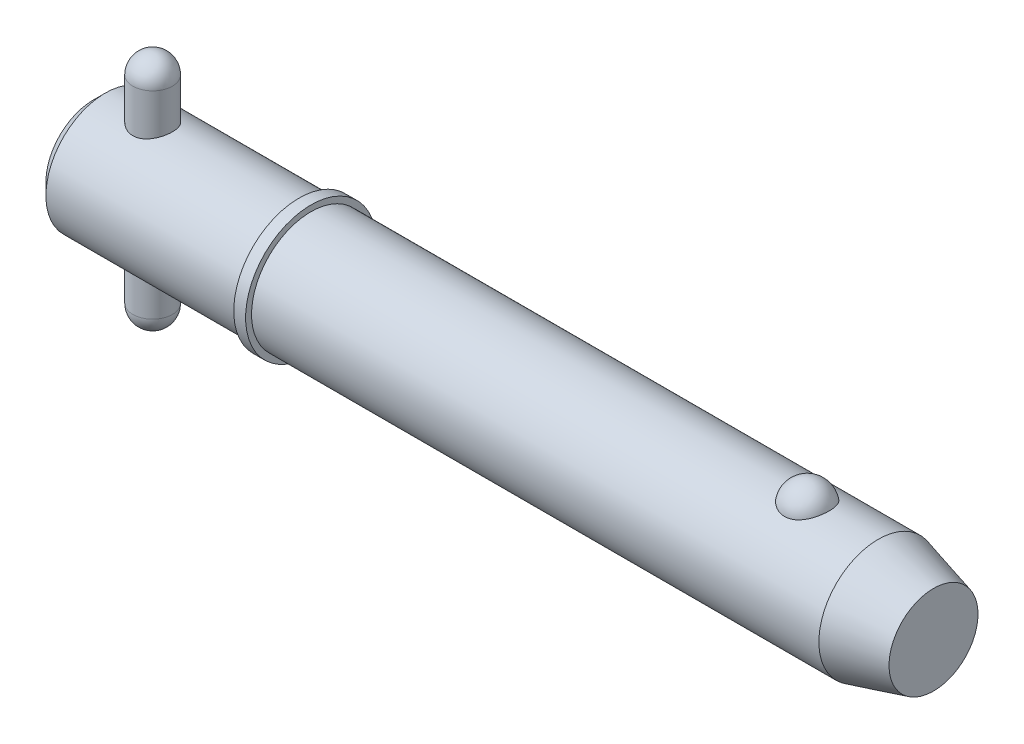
ISO-10303-21;
HEADER;
FILE_DESCRIPTION(('STEP AP214'),'2;1');
FILE_NAME('part.step','',(''),(''),'','','');
FILE_SCHEMA(('AUTOMOTIVE_DESIGN { 1 0 10303 214 1 1 1 1 }'));
ENDSEC;
DATA;
#1=APPLICATION_CONTEXT('core data for automotive mechanical design processes');
#2=APPLICATION_PROTOCOL_DEFINITION('international standard','automotive_design',2000,#1);
#3=PRODUCT_CONTEXT('',#1,'mechanical');
#4=PRODUCT('Part','Part','',(#3));
#5=PRODUCT_RELATED_PRODUCT_CATEGORY('part','',(#4));
#6=PRODUCT_DEFINITION_FORMATION('','',#4);
#7=PRODUCT_DEFINITION_CONTEXT('part definition',#1,'design');
#8=PRODUCT_DEFINITION('design','',#6,#7);
#9=PRODUCT_DEFINITION_SHAPE('','',#8);
#10=(LENGTH_UNIT() NAMED_UNIT(*) SI_UNIT(.MILLI.,.METRE.));
#11=(NAMED_UNIT(*) PLANE_ANGLE_UNIT() SI_UNIT($,.RADIAN.));
#12=(NAMED_UNIT(*) SI_UNIT($,.STERADIAN.) SOLID_ANGLE_UNIT());
#13=UNCERTAINTY_MEASURE_WITH_UNIT(LENGTH_MEASURE(1.E-05),#10,'distance_accuracy_value','');
#14=(GEOMETRIC_REPRESENTATION_CONTEXT(3) GLOBAL_UNCERTAINTY_ASSIGNED_CONTEXT((#13)) GLOBAL_UNIT_ASSIGNED_CONTEXT((#10,
#11,#12)) REPRESENTATION_CONTEXT('',''));
#15=CARTESIAN_POINT('',(0.,0.,0.));
#16=DIRECTION('',(0.,0.,1.));
#17=DIRECTION('',(1.,0.,0.));
#18=AXIS2_PLACEMENT_3D('',#15,#16,#17);
#19=CARTESIAN_POINT('',(9.525,19.05,0.));
#20=DIRECTION('',(0.,-1.,0.));
#21=DIRECTION('',(0.,0.,-1.));
#22=AXIS2_PLACEMENT_3D('',#19,#20,#21);
#23=CYLINDRICAL_SURFACE('',#22,3.175);
#24=CARTESIAN_POINT('',(9.525,-15.875,0.));
#25=DIRECTION('',(0.,-1.,0.));
#26=DIRECTION('',(0.,0.,-1.));
#27=AXIS2_PLACEMENT_3D('',#24,#25,#26);
#28=CIRCLE('',#27,3.175);
#29=CARTESIAN_POINT('',(9.525,-15.875,-3.175));
#30=VERTEX_POINT('',#29);
#31=EDGE_CURVE('P0_E10',#30,#30,#28,.F.);
#32=CARTESIAN_POINT('',(9.525,15.875,0.));
#33=DIRECTION('',(0.,-1.,0.));
#34=DIRECTION('',(0.,0.,-1.));
#35=AXIS2_PLACEMENT_3D('',#32,#33,#34);
#36=CIRCLE('',#35,3.175);
#37=CARTESIAN_POINT('',(9.525,15.875,-3.175));
#38=VERTEX_POINT('',#37);
#39=EDGE_CURVE('P0_E21',#38,#38,#36,.T.);
#40=CARTESIAN_POINT('',(9.525,-15.875,-3.175));
#41=CARTESIAN_POINT('',(9.525,-15.5442708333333,-3.175));
#42=CARTESIAN_POINT('',(9.525,-15.2135416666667,-3.175));
#43=CARTESIAN_POINT('',(9.525,-14.5520833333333,-3.175));
#44=CARTESIAN_POINT('',(9.525,-14.2213541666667,-3.175));
#45=CARTESIAN_POINT('',(9.525,-13.5598958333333,-3.175));
#46=CARTESIAN_POINT('',(9.525,-13.2291666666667,-3.175));
#47=CARTESIAN_POINT('',(9.525,-12.5677083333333,-3.175));
#48=CARTESIAN_POINT('',(9.525,-12.2369791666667,-3.175));
#49=CARTESIAN_POINT('',(9.525,-11.5755208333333,-3.175));
#50=CARTESIAN_POINT('',(9.525,-11.2447916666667,-3.175));
#51=CARTESIAN_POINT('',(9.525,-10.5833333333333,-3.175));
#52=CARTESIAN_POINT('',(9.525,-10.2526041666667,-3.175));
#53=CARTESIAN_POINT('',(9.525,-9.59114583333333,-3.175));
#54=CARTESIAN_POINT('',(9.525,-9.26041666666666,-3.175));
#55=CARTESIAN_POINT('',(9.525,-8.59895833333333,-3.175));
#56=CARTESIAN_POINT('',(9.525,-8.26822916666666,-3.175));
#57=CARTESIAN_POINT('',(9.525,-7.60677083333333,-3.175));
#58=CARTESIAN_POINT('',(9.525,-7.27604166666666,-3.175));
#59=CARTESIAN_POINT('',(9.525,-6.61458333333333,-3.175));
#60=CARTESIAN_POINT('',(9.525,-6.28385416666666,-3.175));
#61=CARTESIAN_POINT('',(9.525,-5.62239583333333,-3.175));
#62=CARTESIAN_POINT('',(9.525,-5.29166666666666,-3.175));
#63=CARTESIAN_POINT('',(9.525,-4.63020833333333,-3.175));
#64=CARTESIAN_POINT('',(9.525,-4.29947916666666,-3.175));
#65=CARTESIAN_POINT('',(9.525,-3.63802083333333,-3.175));
#66=CARTESIAN_POINT('',(9.525,-3.30729166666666,-3.175));
#67=CARTESIAN_POINT('',(9.525,-2.64583333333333,-3.175));
#68=CARTESIAN_POINT('',(9.525,-2.31510416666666,-3.175));
#69=CARTESIAN_POINT('',(9.525,-1.65364583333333,-3.175));
#70=CARTESIAN_POINT('',(9.525,-1.32291666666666,-3.175));
#71=CARTESIAN_POINT('',(9.525,-0.661458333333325,-3.175));
#72=CARTESIAN_POINT('',(9.525,-0.330729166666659,-3.175));
#73=CARTESIAN_POINT('',(9.525,0.330729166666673,-3.175));
#74=CARTESIAN_POINT('',(9.525,0.661458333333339,-3.175));
#75=CARTESIAN_POINT('',(9.525,1.32291666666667,-3.175));
#76=CARTESIAN_POINT('',(9.525,1.65364583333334,-3.175));
#77=CARTESIAN_POINT('',(9.525,2.31510416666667,-3.175));
#78=CARTESIAN_POINT('',(9.525,2.64583333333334,-3.175));
#79=CARTESIAN_POINT('',(9.525,3.30729166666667,-3.175));
#80=CARTESIAN_POINT('',(9.525,3.63802083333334,-3.175));
#81=CARTESIAN_POINT('',(9.525,4.29947916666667,-3.175));
#82=CARTESIAN_POINT('',(9.525,4.63020833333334,-3.175));
#83=CARTESIAN_POINT('',(9.525,5.29166666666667,-3.175));
#84=CARTESIAN_POINT('',(9.525,5.62239583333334,-3.175));
#85=CARTESIAN_POINT('',(9.525,6.28385416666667,-3.175));
#86=CARTESIAN_POINT('',(9.525,6.61458333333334,-3.175));
#87=CARTESIAN_POINT('',(9.525,7.27604166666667,-3.175));
#88=CARTESIAN_POINT('',(9.525,7.60677083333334,-3.175));
#89=CARTESIAN_POINT('',(9.525,8.26822916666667,-3.175));
#90=CARTESIAN_POINT('',(9.525,8.59895833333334,-3.175));
#91=CARTESIAN_POINT('',(9.525,9.26041666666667,-3.175));
#92=CARTESIAN_POINT('',(9.525,9.59114583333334,-3.175));
#93=CARTESIAN_POINT('',(9.525,10.2526041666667,-3.175));
#94=CARTESIAN_POINT('',(9.525,10.5833333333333,-3.175));
#95=CARTESIAN_POINT('',(9.525,11.2447916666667,-3.175));
#96=CARTESIAN_POINT('',(9.525,11.5755208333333,-3.175));
#97=CARTESIAN_POINT('',(9.525,12.2369791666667,-3.175));
#98=CARTESIAN_POINT('',(9.525,12.5677083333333,-3.175));
#99=CARTESIAN_POINT('',(9.525,13.2291666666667,-3.175));
#100=CARTESIAN_POINT('',(9.525,13.5598958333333,-3.175));
#101=CARTESIAN_POINT('',(9.525,14.2213541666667,-3.175));
#102=CARTESIAN_POINT('',(9.525,14.5520833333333,-3.175));
#103=CARTESIAN_POINT('',(9.525,15.2135416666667,-3.175));
#104=CARTESIAN_POINT('',(9.525,15.5442708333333,-3.175));
#105=CARTESIAN_POINT('',(9.525,15.875,-3.175));
#106=B_SPLINE_CURVE_WITH_KNOTS('',3,(#40,#41,#42,#43,#44,#45,#46,#47,#48,#49,#50,#51,#52,#53,
#54,#55,#56,#57,#58,#59,#60,#61,#62,#63,#64,#65,#66,#67,#68,#69,#70,#71,#72,#73,#74,#75,#76,#77,
#78,#79,#80,#81,#82,#83,#84,#85,#86,#87,#88,#89,#90,#91,#92,#93,#94,#95,#96,#97,#98,#99,#100,
#101,#102,#103,#104,#105),.UNSPECIFIED.,.F.,.F.,(4,2,2,2,2,2,2,2,2,2,2,2,2,2,2,2,2,2,2,2,2,2,2,
2,2,2,2,2,2,2,2,2,4),(0.,0.992187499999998,1.984375,2.9765625,3.96875,4.96093749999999,5.953125,
6.9453125,7.9375,8.92968749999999,9.921875,10.9140625,11.90625,12.8984375,13.890625,14.8828125,
15.875,16.8671875,17.859375,18.8515625,19.84375,20.8359375,21.828125,22.8203125,23.8125,
24.8046875,25.796875,26.7890625,27.78125,28.7734375,29.765625,30.7578125,31.75),.UNSPECIFIED.);
#107=EDGE_CURVE('P0_BSEAM14',#30,#38,#106,.T.);
#108=ORIENTED_EDGE('',*,*,#31,.T.);
#109=ORIENTED_EDGE('',*,*,#39,.T.);
#110=ORIENTED_EDGE('',*,*,#107,.T.);
#111=ORIENTED_EDGE('',*,*,#107,.F.);
#112=EDGE_LOOP('',(#108,#110,#109,#111));
#113=FACE_BOUND('',#112,.T.);
#114=ADVANCED_FACE('P0_F14',(#113),#23,.T.);
#115=CARTESIAN_POINT('',(9.525,-15.875,0.));
#116=DIRECTION('',(0.,0.,1.));
#117=DIRECTION('',(1.,0.,0.));
#118=AXIS2_PLACEMENT_3D('',#115,#116,#117);
#119=SPHERICAL_SURFACE('',#118,3.175);
#120=CARTESIAN_POINT('',(9.525,-15.875,0.));
#121=DIRECTION('',(0.,-1.,0.));
#122=DIRECTION('',(0.,0.,-1.));
#123=AXIS2_PLACEMENT_3D('',#120,#121,#122);
#124=SPHERICAL_SURFACE('',#123,3.175);
#125=ORIENTED_EDGE('',*,*,#31,.F.);
#126=EDGE_LOOP('',(#125));
#127=FACE_BOUND('',#126,.T.);
#128=ADVANCED_FACE('P0_F29',(#127),#124,.T.);
#129=CARTESIAN_POINT('',(9.525,15.875,0.));
#130=DIRECTION('',(0.,0.,1.));
#131=DIRECTION('',(1.,0.,0.));
#132=AXIS2_PLACEMENT_3D('',#129,#130,#131);
#133=SPHERICAL_SURFACE('',#132,3.175);
#134=CARTESIAN_POINT('',(9.525,15.875,0.));
#135=DIRECTION('',(0.,-1.,0.));
#136=DIRECTION('',(0.,0.,-1.));
#137=AXIS2_PLACEMENT_3D('',#134,#135,#136);
#138=SPHERICAL_SURFACE('',#137,3.175);
#139=ORIENTED_EDGE('',*,*,#39,.F.);
#140=EDGE_LOOP('',(#139));
#141=FACE_BOUND('',#140,.T.);
#142=ADVANCED_FACE('P0_F16',(#141),#138,.T.);
#143=CLOSED_SHELL('',(#114,#128,#142));
#144=MANIFOLD_SOLID_BREP('P0_B1',#143);
#145=CARTESIAN_POINT('',(0.,0.,0.));
#146=DIRECTION('',(1.,0.,0.));
#147=DIRECTION('',(0.,0.,-1.));
#148=AXIS2_PLACEMENT_3D('',#145,#146,#147);
#149=CYLINDRICAL_SURFACE('',#148,9.525);
#150=CARTESIAN_POINT('',(126.043054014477,0.,0.));
#151=DIRECTION('',(1.,0.,0.));
#152=DIRECTION('',(0.,0.,-1.));
#153=AXIS2_PLACEMENT_3D('',#150,#151,#152);
#154=CIRCLE('',#153,9.525);
#155=CARTESIAN_POINT('',(126.043054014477,0.,-9.525));
#156=VERTEX_POINT('',#155);
#157=EDGE_CURVE('P1_E81',#156,#156,#154,.T.);
#158=ORIENTED_EDGE('',*,*,#157,.F.);
#159=EDGE_LOOP('',(#158));
#160=FACE_BOUND('',#159,.T.);
#161=CARTESIAN_POINT('',(34.93,0.,0.));
#162=DIRECTION('',(1.,0.,0.));
#163=DIRECTION('',(0.,0.,-1.));
#164=AXIS2_PLACEMENT_3D('',#161,#162,#163);
#165=CIRCLE('',#164,9.525);
#166=CARTESIAN_POINT('',(34.93,0.,-9.525));
#167=VERTEX_POINT('',#166);
#168=EDGE_CURVE('P1_E85',#167,#167,#165,.T.);
#169=ORIENTED_EDGE('',*,*,#168,.T.);
#170=EDGE_LOOP('',(#169));
#171=FACE_BOUND('',#170,.T.);
#172=CARTESIAN_POINT('',(114.645757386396,8.80405803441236,3.63513233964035));
#173=CARTESIAN_POINT('',(114.551676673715,8.80405953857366,3.63513053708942));
#174=CARTESIAN_POINT('',(114.457561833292,8.80561325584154,3.6313746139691));
#175=CARTESIAN_POINT('',(114.270012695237,8.81177748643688,3.61638665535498));
#176=CARTESIAN_POINT('',(114.176578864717,8.81638992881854,3.60514990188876));
#177=CARTESIAN_POINT('',(113.897945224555,8.8346711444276,3.56024627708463));
#178=CARTESIAN_POINT('',(113.714691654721,8.85278327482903,3.51538626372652));
#179=CARTESIAN_POINT('',(113.359509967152,8.89871214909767,3.39742145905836));
#180=CARTESIAN_POINT('',(113.187553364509,8.9265032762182,3.32439116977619));
#181=CARTESIAN_POINT('',(112.858707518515,8.98874819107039,3.15220244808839));
#182=CARTESIAN_POINT('',(112.701811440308,9.02319893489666,3.05305594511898));
#183=CARTESIAN_POINT('',(112.402214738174,9.09629186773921,2.82797815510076));
#184=CARTESIAN_POINT('',(112.260060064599,9.13502685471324,2.7013513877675));
#185=CARTESIAN_POINT('',(111.998299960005,9.2118657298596,2.4264193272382));
#186=CARTESIAN_POINT('',(111.878701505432,9.2499694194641,2.27810735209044));
#187=CARTESIAN_POINT('',(111.659645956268,9.3234108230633,1.95652290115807));
#188=CARTESIAN_POINT('',(111.561317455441,9.35855090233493,1.78243511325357));
#189=CARTESIAN_POINT('',(111.393819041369,9.42045142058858,1.41937246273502));
#190=CARTESIAN_POINT('',(111.324651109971,9.44721128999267,1.23039658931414));
#191=CARTESIAN_POINT('',(111.216199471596,9.48990641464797,0.840370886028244));
#192=CARTESIAN_POINT('',(111.177288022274,9.50570658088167,0.639202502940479));
#193=CARTESIAN_POINT('',(111.131555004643,9.52433146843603,0.232664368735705));
#194=CARTESIAN_POINT('',(111.124732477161,9.52715657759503,0.0272947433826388));
#195=CARTESIAN_POINT('',(111.143255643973,9.51956918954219,-0.380478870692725));
#196=CARTESIAN_POINT('',(111.168405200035,9.50923740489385,-0.58289331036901));
#197=CARTESIAN_POINT('',(111.25002537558,9.47651897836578,-0.980293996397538));
#198=CARTESIAN_POINT('',(111.306496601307,9.45413210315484,-1.17528009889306));
#199=CARTESIAN_POINT('',(111.449719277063,9.39954044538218,-1.55263697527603));
#200=CARTESIAN_POINT('',(111.536512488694,9.36732213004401,-1.73498993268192));
#201=CARTESIAN_POINT('',(111.738610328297,9.29640700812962,-2.08177763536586));
#202=CARTESIAN_POINT('',(111.853917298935,9.25770966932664,-2.24621090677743));
#203=CARTESIAN_POINT('',(112.111264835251,9.17775604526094,-2.5533833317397));
#204=CARTESIAN_POINT('',(112.253434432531,9.136488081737,-2.696011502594));
#205=CARTESIAN_POINT('',(112.56089985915,9.05620497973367,-2.95451229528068));
#206=CARTESIAN_POINT('',(112.726193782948,9.01718965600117,-3.07038711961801));
#207=CARTESIAN_POINT('',(113.072052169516,8.9468001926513,-3.26976836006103));
#208=CARTESIAN_POINT('',(113.252227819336,8.91528408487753,-3.35389750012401));
#209=CARTESIAN_POINT('',(113.625651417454,8.86272514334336,-3.49043503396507));
#210=CARTESIAN_POINT('',(113.818894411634,8.8416783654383,-3.54285537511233));
#211=CARTESIAN_POINT('',(114.202503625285,8.81348056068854,-3.61241306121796));
#212=CARTESIAN_POINT('',(114.392525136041,8.80568348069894,-3.63119339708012));
#213=CARTESIAN_POINT('',(114.773190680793,8.80289410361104,-3.63795342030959));
#214=CARTESIAN_POINT('',(114.963834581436,8.80789922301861,-3.62593932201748));
#215=CARTESIAN_POINT('',(115.334007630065,8.8297491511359,-3.57238430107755));
#216=CARTESIAN_POINT('',(115.513697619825,8.84621463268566,-3.53178890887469));
#217=CARTESIAN_POINT('',(115.863422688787,8.88875330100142,-3.42331083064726));
#218=CARTESIAN_POINT('',(116.033456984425,8.91482726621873,-3.35542593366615));
#219=CARTESIAN_POINT('',(116.363237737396,8.97448239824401,-3.19248225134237));
#220=CARTESIAN_POINT('',(116.522680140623,9.00821446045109,-3.09686474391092));
#221=CARTESIAN_POINT('',(116.823513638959,9.07935398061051,-2.88162736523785));
#222=CARTESIAN_POINT('',(116.964900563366,9.11676228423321,-2.76200196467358));
#223=CARTESIAN_POINT('',(117.23331931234,9.19347419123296,-2.49516285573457));
#224=CARTESIAN_POINT('',(117.359275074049,9.23277872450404,-2.34686614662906));
#225=CARTESIAN_POINT('',(117.585522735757,9.30737610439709,-2.03093683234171));
#226=CARTESIAN_POINT('',(117.68581004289,9.34266823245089,-1.86330077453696));
#227=CARTESIAN_POINT('',(117.861514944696,9.40674710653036,-1.50744893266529));
#228=CARTESIAN_POINT('',(117.936041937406,9.4352917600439,-1.31874876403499));
#229=CARTESIAN_POINT('',(118.05416505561,9.48144132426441,-0.930631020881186));
#230=CARTESIAN_POINT('',(118.097760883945,9.49904612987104,-0.731213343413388));
#231=CARTESIAN_POINT('',(118.153158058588,9.5215314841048,-0.327147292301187));
#232=CARTESIAN_POINT('',(118.164935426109,9.52640243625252,-0.122495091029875));
#233=CARTESIAN_POINT('',(118.156382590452,9.52289571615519,0.286018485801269));
#234=CARTESIAN_POINT('',(118.13605305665,9.51451832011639,0.489879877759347));
#235=CARTESIAN_POINT('',(118.063884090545,9.48544083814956,0.88999431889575));
#236=CARTESIAN_POINT('',(118.012199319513,9.46480124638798,1.08627971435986));
#237=CARTESIAN_POINT('',(117.878491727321,9.4133389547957,1.46682086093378));
#238=CARTESIAN_POINT('',(117.796466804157,9.38251554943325,1.65107577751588));
#239=CARTESIAN_POINT('',(117.60319292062,9.31365636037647,2.00346348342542));
#240=CARTESIAN_POINT('',(117.491783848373,9.27558138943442,2.17150083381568));
#241=CARTESIAN_POINT('',(117.242294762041,9.19638714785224,2.48563115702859));
#242=CARTESIAN_POINT('',(117.104216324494,9.15526805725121,2.63172542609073));
#243=CARTESIAN_POINT('',(116.804843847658,9.07465393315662,2.89750997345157));
#244=CARTESIAN_POINT('',(116.643610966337,9.03515496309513,3.01726776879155));
#245=CARTESIAN_POINT('',(116.301613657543,8.96227564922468,3.22732920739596));
#246=CARTESIAN_POINT('',(116.120841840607,8.92889763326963,3.31762165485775));
#247=CARTESIAN_POINT('',(115.751445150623,8.8734538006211,3.46314419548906));
#248=CARTESIAN_POINT('',(115.56332371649,8.85102983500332,3.51950082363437));
#249=CARTESIAN_POINT('',(115.27578699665,8.8266696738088,3.57993683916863));
#250=CARTESIAN_POINT('',(115.179133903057,8.82009725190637,3.59606217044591));
#251=CARTESIAN_POINT('',(114.984677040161,8.81020897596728,3.62022512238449));
#252=CARTESIAN_POINT('',(114.88687410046,8.80689090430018,3.62826825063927));
#253=CARTESIAN_POINT('',(114.741224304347,8.80445615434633,3.63416760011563));
#254=CARTESIAN_POINT('',(114.693495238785,8.80405727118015,3.63513325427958));
#255=CARTESIAN_POINT('',(114.645757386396,8.80405803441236,3.63513233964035));
#256=B_SPLINE_CURVE_WITH_KNOTS('',3,(#172,#173,#174,#175,#176,#177,#178,#179,#180,#181,#182,
#183,#184,#185,#186,#187,#188,#189,#190,#191,#192,#193,#194,#195,#196,#197,#198,#199,#200,#201,
#202,#203,#204,#205,#206,#207,#208,#209,#210,#211,#212,#213,#214,#215,#216,#217,#218,#219,#220,
#221,#222,#223,#224,#225,#226,#227,#228,#229,#230,#231,#232,#233,#234,#235,#236,#237,#238,#239,
#240,#241,#242,#243,#244,#245,#246,#247,#248,#249,#250,#251,#252,#253,#254,#255),.UNSPECIFIED.,
.T.,.F.,(4,2,2,2,2,2,2,2,2,2,2,2,2,2,2,2,2,2,2,2,2,2,2,2,2,2,2,2,2,2,2,2,2,2,2,2,2,2,2,2,2,4),
(0.,0.282202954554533,0.564584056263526,1.13017050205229,1.69427128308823,2.258114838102,
2.83836627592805,3.41879688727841,4.02497117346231,4.63118665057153,5.24474754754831,
5.85829010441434,6.46808687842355,7.07789545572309,7.68854723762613,8.29924920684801,
8.91296283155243,9.52662591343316,10.1275338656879,10.7282152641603,11.2986646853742,
11.868998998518,12.4213015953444,12.973648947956,13.5380053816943,14.1024919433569,
14.695298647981,15.2882113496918,15.8999469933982,16.5116885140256,17.1238909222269,
17.7360805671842,18.3452748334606,18.9545113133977,19.567138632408,20.1797297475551,
20.7907316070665,21.4019653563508,21.9915938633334,22.2859053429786,22.5800161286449,
22.723209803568),.UNSPECIFIED.);
#257=CARTESIAN_POINT('',(114.645757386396,8.80405803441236,3.63513233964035));
#258=VERTEX_POINT('',#257);
#259=EDGE_CURVE('P1_E35',#258,#258,#256,.T.);
#260=ORIENTED_EDGE('',*,*,#259,.T.);
#261=EDGE_LOOP('',(#260));
#262=FACE_BOUND('',#261,.T.);
#263=ADVANCED_FACE('P1_F13',(#160,#171,#262),#149,.T.);
#264=CARTESIAN_POINT('',(0.,0.,0.));
#265=DIRECTION('',(-1.,0.,0.));
#266=DIRECTION('',(0.,0.,1.));
#267=AXIS2_PLACEMENT_3D('',#264,#265,#266);
#268=PLANE('',#267);
#269=CARTESIAN_POINT('',(0.,0.,0.));
#270=DIRECTION('',(1.,0.,0.));
#271=DIRECTION('',(0.,0.,-1.));
#272=AXIS2_PLACEMENT_3D('',#269,#270,#271);
#273=CIRCLE('',#272,7.62);
#274=CARTESIAN_POINT('',(0.,0.,-7.62));
#275=VERTEX_POINT('',#274);
#276=EDGE_CURVE('P1_E9',#275,#275,#273,.T.);
#277=ORIENTED_EDGE('',*,*,#276,.F.);
#278=EDGE_LOOP('',(#277));
#279=FACE_BOUND('',#278,.T.);
#280=ADVANCED_FACE('P1_F15',(#279),#268,.T.);
#281=CARTESIAN_POINT('',(1.90499999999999,0.,0.));
#282=DIRECTION('',(1.,0.,0.));
#283=DIRECTION('',(0.,0.,-1.));
#284=AXIS2_PLACEMENT_3D('',#281,#282,#283);
#285=CONICAL_SURFACE('',#284,9.525,0.785398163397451);
#286=ORIENTED_EDGE('',*,*,#276,.T.);
#287=EDGE_LOOP('',(#286));
#288=FACE_BOUND('',#287,.T.);
#289=CARTESIAN_POINT('',(1.90499999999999,0.,0.));
#290=DIRECTION('',(1.,0.,0.));
#291=DIRECTION('',(0.,0.,-1.));
#292=AXIS2_PLACEMENT_3D('',#289,#290,#291);
#293=CIRCLE('',#292,9.525);
#294=CARTESIAN_POINT('',(1.90499999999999,0.,-9.525));
#295=VERTEX_POINT('',#294);
#296=EDGE_CURVE('P1_E26',#295,#295,#293,.T.);
#297=ORIENTED_EDGE('',*,*,#296,.F.);
#298=EDGE_LOOP('',(#297));
#299=FACE_BOUND('',#298,.T.);
#300=ADVANCED_FACE('P1_F77',(#288,#299),#285,.T.);
#301=CARTESIAN_POINT('',(0.,0.,0.));
#302=DIRECTION('',(1.,0.,0.));
#303=DIRECTION('',(0.,0.,-1.));
#304=AXIS2_PLACEMENT_3D('',#301,#302,#303);
#305=CYLINDRICAL_SURFACE('',#304,9.525);
#306=CARTESIAN_POINT('',(9.525,-8.98025612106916,3.175));
#307=CARTESIAN_POINT('',(9.35206354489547,-8.98025555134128,3.17500081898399));
#308=CARTESIAN_POINT('',(9.17913201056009,-8.98530617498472,3.16082293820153));
#309=CARTESIAN_POINT('',(8.83839221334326,-9.00485797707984,3.10467734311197));
#310=CARTESIAN_POINT('',(8.67058479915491,-9.0193607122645,3.06270505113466));
#311=CARTESIAN_POINT('',(8.34508461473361,-9.05599546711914,2.95260866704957));
#312=CARTESIAN_POINT('',(8.18737272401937,-9.07811252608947,2.88453582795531));
#313=CARTESIAN_POINT('',(7.88555684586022,-9.12746212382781,2.72434567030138));
#314=CARTESIAN_POINT('',(7.74145587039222,-9.1546957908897,2.63222304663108));
#315=CARTESIAN_POINT('',(7.46531411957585,-9.21240503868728,2.42268738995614));
#316=CARTESIAN_POINT('',(7.33388351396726,-9.24296141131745,2.30449228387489));
#317=CARTESIAN_POINT('',(7.09229340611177,-9.30319020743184,2.0478358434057));
#318=CARTESIAN_POINT('',(6.98213731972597,-9.33286248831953,1.90937126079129));
#319=CARTESIAN_POINT('',(6.78345450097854,-9.38891527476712,1.61164431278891));
#320=CARTESIAN_POINT('',(6.69556709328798,-9.41518969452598,1.45193356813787));
#321=CARTESIAN_POINT('',(6.54814671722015,-9.46053437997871,1.11896913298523));
#322=CARTESIAN_POINT('',(6.48860610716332,-9.47960658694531,0.945719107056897));
#323=CARTESIAN_POINT('',(6.40163866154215,-9.50782564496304,0.596991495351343));
#324=CARTESIAN_POINT('',(6.373166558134,-9.5172947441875,0.421801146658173));
#325=CARTESIAN_POINT('',(6.3458207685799,-9.52638456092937,0.068890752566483));
#326=CARTESIAN_POINT('',(6.34693945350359,-9.52600781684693,-0.108828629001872));
#327=CARTESIAN_POINT('',(6.37808050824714,-9.51566675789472,-0.454353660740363));
#328=CARTESIAN_POINT('',(6.4069675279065,-9.50607905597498,-0.622274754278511));
#329=CARTESIAN_POINT('',(6.490947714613,-9.47886621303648,-0.950732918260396));
#330=CARTESIAN_POINT('',(6.54604265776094,-9.46124052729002,-1.11126948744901));
#331=CARTESIAN_POINT('',(6.68153768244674,-9.41945253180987,-1.42288410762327));
#332=CARTESIAN_POINT('',(6.76226085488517,-9.3952073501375,-1.57381010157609));
#333=CARTESIAN_POINT('',(6.94645456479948,-9.34270397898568,-1.86030973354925));
#334=CARTESIAN_POINT('',(7.04993142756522,-9.31444467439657,-1.99587908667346));
#335=CARTESIAN_POINT('',(7.28241619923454,-9.25532159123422,-2.2545702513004));
#336=CARTESIAN_POINT('',(7.4123967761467,-9.22439783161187,-2.37680549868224));
#337=CARTESIAN_POINT('',(7.69127470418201,-9.1645528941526,-2.5980302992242));
#338=CARTESIAN_POINT('',(7.84017496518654,-9.13563202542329,-2.6970162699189));
#339=CARTESIAN_POINT('',(8.15547526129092,-9.08273917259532,-2.87016016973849));
#340=CARTESIAN_POINT('',(8.32209451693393,-9.05884361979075,-2.94394402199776));
#341=CARTESIAN_POINT('',(8.66638917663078,-9.01959241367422,-3.06210713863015));
#342=CARTESIAN_POINT('',(8.84405991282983,-9.00423318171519,-3.10649872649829));
#343=CARTESIAN_POINT('',(9.19682677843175,-8.98460345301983,-3.16281207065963));
#344=CARTESIAN_POINT('',(9.37167742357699,-8.9798639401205,-3.17610837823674));
#345=CARTESIAN_POINT('',(9.72113927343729,-8.9806993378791,-3.17374726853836));
#346=CARTESIAN_POINT('',(9.89575051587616,-8.98627237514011,-3.15809511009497));
#347=CARTESIAN_POINT('',(10.2335233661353,-9.00663737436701,-3.09951644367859));
#348=CARTESIAN_POINT('',(10.3968722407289,-9.02110608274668,-3.05754530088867));
#349=CARTESIAN_POINT('',(10.7141759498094,-9.05727657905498,-2.94866651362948));
#350=CARTESIAN_POINT('',(10.8681291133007,-9.07897964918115,-2.88175444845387));
#351=CARTESIAN_POINT('',(11.1676828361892,-9.12802586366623,-2.72248103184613));
#352=CARTESIAN_POINT('',(11.3128635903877,-9.1555260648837,-2.62937980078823));
#353=CARTESIAN_POINT('',(11.5860387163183,-9.21276315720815,-2.42120937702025));
#354=CARTESIAN_POINT('',(11.7140280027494,-9.24250070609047,-2.30613370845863));
#355=CARTESIAN_POINT('',(11.9555513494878,-9.30259247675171,-2.05070616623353));
#356=CARTESIAN_POINT('',(12.0680936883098,-9.33290753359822,-1.90940458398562));
#357=CARTESIAN_POINT('',(12.267933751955,-9.3893275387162,-1.60917665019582));
#358=CARTESIAN_POINT('',(12.3552323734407,-9.41543263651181,-1.45025092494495));
#359=CARTESIAN_POINT('',(12.5013088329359,-9.46036988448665,-1.12007606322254));
#360=CARTESIAN_POINT('',(12.5602723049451,-9.47924920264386,-0.9489158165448));
#361=CARTESIAN_POINT('',(12.6483355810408,-9.50781089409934,-0.598355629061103));
#362=CARTESIAN_POINT('',(12.6774461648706,-9.5174965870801,-0.4189586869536));
#363=CARTESIAN_POINT('',(12.7040070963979,-9.52632915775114,-0.066088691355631));
#364=CARTESIAN_POINT('',(12.7028811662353,-9.52594996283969,0.107266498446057));
#365=CARTESIAN_POINT('',(12.6725130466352,-9.51586223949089,0.451202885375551));
#366=CARTESIAN_POINT('',(12.643273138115,-9.50615446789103,0.621784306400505));
#367=CARTESIAN_POINT('',(12.5584514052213,-9.47867404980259,0.952633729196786));
#368=CARTESIAN_POINT('',(12.5032953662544,-9.46103195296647,1.1130225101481));
#369=CARTESIAN_POINT('',(12.3686013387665,-9.41949985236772,1.42233126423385));
#370=CARTESIAN_POINT('',(12.2890589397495,-9.39560871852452,1.57124915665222));
#371=CARTESIAN_POINT('',(12.1044667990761,-9.34294133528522,1.85938800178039));
#372=CARTESIAN_POINT('',(11.9985831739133,-9.31401720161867,1.9980473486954));
#373=CARTESIAN_POINT('',(11.7657327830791,-9.25490239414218,2.25609475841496));
#374=CARTESIAN_POINT('',(11.6387592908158,-9.22471131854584,2.37547664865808));
#375=CARTESIAN_POINT('',(11.3613902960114,-9.16505913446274,2.59633024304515));
#376=CARTESIAN_POINT('',(11.2102725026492,-9.13567286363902,2.69691791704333));
#377=CARTESIAN_POINT('',(10.8923631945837,-9.08241113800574,2.87119803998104));
#378=CARTESIAN_POINT('',(10.7255757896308,-9.05853424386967,2.94489751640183));
#379=CARTESIAN_POINT('',(10.3887212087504,-9.02021736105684,3.06020415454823));
#380=CARTESIAN_POINT('',(10.219143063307,-9.00539959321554,3.10311136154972));
#381=CARTESIAN_POINT('',(9.87470703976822,-8.98542092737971,3.16050396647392));
#382=CARTESIAN_POINT('',(9.699851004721,-8.98025669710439,3.17499917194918));
#383=CARTESIAN_POINT('',(9.525,-8.98025612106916,3.175));
#384=B_SPLINE_CURVE_WITH_KNOTS('',3,(#306,#307,#308,#309,#310,#311,#312,#313,#314,#315,#316,
#317,#318,#319,#320,#321,#322,#323,#324,#325,#326,#327,#328,#329,#330,#331,#332,#333,#334,#335,
#336,#337,#338,#339,#340,#341,#342,#343,#344,#345,#346,#347,#348,#349,#350,#351,#352,#353,#354,
#355,#356,#357,#358,#359,#360,#361,#362,#363,#364,#365,#366,#367,#368,#369,#370,#371,#372,#373,
#374,#375,#376,#377,#378,#379,#380,#381,#382,#383),.UNSPECIFIED.,.T.,.F.,(4,2,2,2,2,2,2,2,2,2,2,
2,2,2,2,2,2,2,2,2,2,2,2,2,2,2,2,2,2,2,2,2,2,2,2,2,2,2,4),(0.,0.518161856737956,1.03640907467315,
1.55364379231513,2.07099270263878,2.60671746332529,3.14252816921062,3.69231882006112,
4.24196117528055,4.77247962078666,5.30286129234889,5.81244090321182,6.32205505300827,
6.83836754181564,7.3548237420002,7.89559553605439,8.43645060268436,8.98501631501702,
9.53335188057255,10.056948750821,10.5804505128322,11.0859695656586,11.5915782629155,
12.1132237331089,12.6350231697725,13.1819271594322,13.7288117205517,14.2720628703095,
14.815117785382,15.3326491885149,15.8501386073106,16.3594083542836,16.868770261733,
17.3969527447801,17.925304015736,18.4743376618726,19.023227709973,19.5473069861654,
20.0712053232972),.UNSPECIFIED.);
#385=CARTESIAN_POINT('',(9.525,-8.98025612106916,3.175));
#386=VERTEX_POINT('',#385);
#387=EDGE_CURVE('P1_E17',#386,#386,#384,.T.);
#388=ORIENTED_EDGE('',*,*,#387,.F.);
#389=EDGE_LOOP('',(#388));
#390=FACE_BOUND('',#389,.T.);
#391=CARTESIAN_POINT('',(9.525,8.98025612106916,3.175));
#392=CARTESIAN_POINT('',(9.69793645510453,8.98025555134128,3.17500081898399));
#393=CARTESIAN_POINT('',(9.87086798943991,8.98530617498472,3.16082293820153));
#394=CARTESIAN_POINT('',(10.2116077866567,9.00485797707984,3.10467734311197));
#395=CARTESIAN_POINT('',(10.3794152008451,9.0193607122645,3.06270505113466));
#396=CARTESIAN_POINT('',(10.7049153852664,9.05599546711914,2.95260866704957));
#397=CARTESIAN_POINT('',(10.8626272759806,9.07811252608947,2.88453582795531));
#398=CARTESIAN_POINT('',(11.1644431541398,9.12746212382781,2.72434567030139));
#399=CARTESIAN_POINT('',(11.3085441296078,9.15469579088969,2.63222304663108));
#400=CARTESIAN_POINT('',(11.5846858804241,9.21240503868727,2.42268738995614));
#401=CARTESIAN_POINT('',(11.7161164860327,9.24296141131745,2.30449228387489));
#402=CARTESIAN_POINT('',(11.9577065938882,9.30319020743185,2.0478358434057));
#403=CARTESIAN_POINT('',(12.067862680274,9.33286248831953,1.90937126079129));
#404=CARTESIAN_POINT('',(12.2665454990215,9.38891527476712,1.61164431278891));
#405=CARTESIAN_POINT('',(12.354432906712,9.41518969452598,1.45193356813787));
#406=CARTESIAN_POINT('',(12.5018532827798,9.46053437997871,1.11896913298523));
#407=CARTESIAN_POINT('',(12.5613938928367,9.47960658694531,0.945719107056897));
#408=CARTESIAN_POINT('',(12.6483613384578,9.50782564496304,0.596991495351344));
#409=CARTESIAN_POINT('',(12.676833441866,9.5172947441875,0.421801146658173));
#410=CARTESIAN_POINT('',(12.7041792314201,9.52638456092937,0.0688907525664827));
#411=CARTESIAN_POINT('',(12.7030605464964,9.52600781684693,-0.108828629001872));
#412=CARTESIAN_POINT('',(12.6719194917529,9.51566675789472,-0.454353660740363));
#413=CARTESIAN_POINT('',(12.6430324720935,9.50607905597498,-0.622274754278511));
#414=CARTESIAN_POINT('',(12.559052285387,9.47886621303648,-0.950732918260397));
#415=CARTESIAN_POINT('',(12.5039573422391,9.46124052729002,-1.11126948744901));
#416=CARTESIAN_POINT('',(12.3684623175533,9.41945253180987,-1.42288410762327));
#417=CARTESIAN_POINT('',(12.2877391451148,9.3952073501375,-1.57381010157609));
#418=CARTESIAN_POINT('',(12.1035454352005,9.34270397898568,-1.86030973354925));
#419=CARTESIAN_POINT('',(12.0000685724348,9.31444467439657,-1.99587908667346));
#420=CARTESIAN_POINT('',(11.7675838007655,9.25532159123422,-2.2545702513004));
#421=CARTESIAN_POINT('',(11.6376032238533,9.22439783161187,-2.37680549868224));
#422=CARTESIAN_POINT('',(11.358725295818,9.1645528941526,-2.5980302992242));
#423=CARTESIAN_POINT('',(11.2098250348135,9.13563202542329,-2.6970162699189));
#424=CARTESIAN_POINT('',(10.8945247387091,9.08273917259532,-2.87016016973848));
#425=CARTESIAN_POINT('',(10.7279054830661,9.05884361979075,-2.94394402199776));
#426=CARTESIAN_POINT('',(10.3836108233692,9.01959241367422,-3.06210713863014));
#427=CARTESIAN_POINT('',(10.2059400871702,9.00423318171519,-3.10649872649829));
#428=CARTESIAN_POINT('',(9.85317322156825,8.98460345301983,-3.16281207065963));
#429=CARTESIAN_POINT('',(9.67832257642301,8.9798639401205,-3.17610837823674));
#430=CARTESIAN_POINT('',(9.32886072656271,8.9806993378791,-3.17374726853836));
#431=CARTESIAN_POINT('',(9.15424948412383,8.98627237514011,-3.15809511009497));
#432=CARTESIAN_POINT('',(8.81647663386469,9.00663737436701,-3.09951644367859));
#433=CARTESIAN_POINT('',(8.65312775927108,9.02110608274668,-3.05754530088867));
#434=CARTESIAN_POINT('',(8.33582405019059,9.05727657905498,-2.94866651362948));
#435=CARTESIAN_POINT('',(8.18187088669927,9.07897964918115,-2.88175444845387));
#436=CARTESIAN_POINT('',(7.88231716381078,9.12802586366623,-2.72248103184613));
#437=CARTESIAN_POINT('',(7.73713640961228,9.1555260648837,-2.62937980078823));
#438=CARTESIAN_POINT('',(7.46396128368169,9.21276315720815,-2.42120937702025));
#439=CARTESIAN_POINT('',(7.33597199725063,9.24250070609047,-2.30613370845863));
#440=CARTESIAN_POINT('',(7.09444865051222,9.30259247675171,-2.05070616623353));
#441=CARTESIAN_POINT('',(6.98190631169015,9.33290753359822,-1.90940458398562));
#442=CARTESIAN_POINT('',(6.78206624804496,9.3893275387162,-1.60917665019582));
#443=CARTESIAN_POINT('',(6.6947676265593,9.41543263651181,-1.45025092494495));
#444=CARTESIAN_POINT('',(6.54869116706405,9.46036988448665,-1.12007606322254));
#445=CARTESIAN_POINT('',(6.48972769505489,9.47924920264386,-0.948915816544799));
#446=CARTESIAN_POINT('',(6.40166441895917,9.50781089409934,-0.598355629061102));
#447=CARTESIAN_POINT('',(6.3725538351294,9.5174965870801,-0.418958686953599));
#448=CARTESIAN_POINT('',(6.34599290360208,9.52632915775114,-0.0660886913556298));
#449=CARTESIAN_POINT('',(6.3471188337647,9.52594996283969,0.107266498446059));
#450=CARTESIAN_POINT('',(6.37748695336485,9.51586223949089,0.451202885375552));
#451=CARTESIAN_POINT('',(6.40672686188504,9.50615446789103,0.621784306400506));
#452=CARTESIAN_POINT('',(6.49154859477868,9.47867404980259,0.952633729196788));
#453=CARTESIAN_POINT('',(6.54670463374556,9.46103195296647,1.11302251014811));
#454=CARTESIAN_POINT('',(6.68139866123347,9.41949985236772,1.42233126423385));
#455=CARTESIAN_POINT('',(6.76094106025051,9.39560871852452,1.57124915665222));
#456=CARTESIAN_POINT('',(6.94553320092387,9.34294133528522,1.85938800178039));
#457=CARTESIAN_POINT('',(7.05141682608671,9.31401720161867,1.9980473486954));
#458=CARTESIAN_POINT('',(7.28426721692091,9.25490239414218,2.25609475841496));
#459=CARTESIAN_POINT('',(7.41124070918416,9.22471131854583,2.37547664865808));
#460=CARTESIAN_POINT('',(7.68860970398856,9.16505913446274,2.59633024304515));
#461=CARTESIAN_POINT('',(7.83972749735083,9.13567286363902,2.69691791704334));
#462=CARTESIAN_POINT('',(8.15763680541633,9.08241113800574,2.87119803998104));
#463=CARTESIAN_POINT('',(8.32442421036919,9.05853424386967,2.94489751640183));
#464=CARTESIAN_POINT('',(8.66127879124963,9.02021736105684,3.06020415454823));
#465=CARTESIAN_POINT('',(8.83085693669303,9.00539959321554,3.10311136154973));
#466=CARTESIAN_POINT('',(9.17529296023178,8.98542092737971,3.16050396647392));
#467=CARTESIAN_POINT('',(9.350148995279,8.98025669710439,3.17499917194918));
#468=CARTESIAN_POINT('',(9.525,8.98025612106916,3.175));
#469=B_SPLINE_CURVE_WITH_KNOTS('',3,(#391,#392,#393,#394,#395,#396,#397,#398,#399,#400,#401,
#402,#403,#404,#405,#406,#407,#408,#409,#410,#411,#412,#413,#414,#415,#416,#417,#418,#419,#420,
#421,#422,#423,#424,#425,#426,#427,#428,#429,#430,#431,#432,#433,#434,#435,#436,#437,#438,#439,
#440,#441,#442,#443,#444,#445,#446,#447,#448,#449,#450,#451,#452,#453,#454,#455,#456,#457,#458,
#459,#460,#461,#462,#463,#464,#465,#466,#467,#468),.UNSPECIFIED.,.T.,.F.,(4,2,2,2,2,2,2,2,2,2,2,
2,2,2,2,2,2,2,2,2,2,2,2,2,2,2,2,2,2,2,2,2,2,2,2,2,2,2,4),(0.,0.518161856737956,1.03640907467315,
1.55364379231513,2.07099270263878,2.60671746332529,3.14252816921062,3.69231882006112,
4.24196117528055,4.77247962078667,5.30286129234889,5.81244090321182,6.32205505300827,
6.83836754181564,7.3548237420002,7.89559553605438,8.43645060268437,8.98501631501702,
9.53335188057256,10.056948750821,10.5804505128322,11.0859695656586,11.5915782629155,
12.1132237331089,12.6350231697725,13.1819271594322,13.7288117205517,14.2720628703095,
14.815117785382,15.3326491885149,15.8501386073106,16.3594083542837,16.868770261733,
17.3969527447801,17.9253040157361,18.4743376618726,19.023227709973,19.5473069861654,
20.0712053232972),.UNSPECIFIED.);
#470=CARTESIAN_POINT('',(9.525,8.98025612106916,3.175));
#471=VERTEX_POINT('',#470);
#472=EDGE_CURVE('P1_E43',#471,#471,#469,.T.);
#473=ORIENTED_EDGE('',*,*,#472,.F.);
#474=EDGE_LOOP('',(#473));
#475=FACE_BOUND('',#474,.T.);
#476=ORIENTED_EDGE('',*,*,#296,.T.);
#477=EDGE_LOOP('',(#476));
#478=FACE_BOUND('',#477,.T.);
#479=CARTESIAN_POINT('',(33.025,0.,0.));
#480=DIRECTION('',(1.,0.,0.));
#481=DIRECTION('',(0.,0.,-1.));
#482=AXIS2_PLACEMENT_3D('',#479,#480,#481);
#483=CIRCLE('',#482,9.525);
#484=CARTESIAN_POINT('',(33.025,0.,-9.525));
#485=VERTEX_POINT('',#484);
#486=EDGE_CURVE('P1_E31',#485,#485,#483,.T.);
#487=ORIENTED_EDGE('',*,*,#486,.F.);
#488=EDGE_LOOP('',(#487));
#489=FACE_BOUND('',#488,.T.);
#490=ADVANCED_FACE('P1_F103',(#390,#475,#478,#489),#305,.T.);
#491=CARTESIAN_POINT('',(33.025,9.525,0.));
#492=DIRECTION('',(-1.,0.,0.));
#493=DIRECTION('',(0.,0.,1.));
#494=AXIS2_PLACEMENT_3D('',#491,#492,#493);
#495=PLANE('',#494);
#496=ORIENTED_EDGE('',*,*,#486,.T.);
#497=EDGE_LOOP('',(#496));
#498=FACE_BOUND('',#497,.T.);
#499=CARTESIAN_POINT('',(33.025,0.,0.));
#500=DIRECTION('',(1.,0.,0.));
#501=DIRECTION('',(0.,0.,-1.));
#502=AXIS2_PLACEMENT_3D('',#499,#500,#501);
#503=CIRCLE('',#502,10.4775);
#504=CARTESIAN_POINT('',(33.025,0.,-10.4775));
#505=VERTEX_POINT('',#504);
#506=EDGE_CURVE('P1_E91',#505,#505,#503,.T.);
#507=ORIENTED_EDGE('',*,*,#506,.F.);
#508=EDGE_LOOP('',(#507));
#509=FACE_BOUND('',#508,.T.);
#510=ADVANCED_FACE('P1_F100',(#498,#509),#495,.T.);
#511=CARTESIAN_POINT('',(0.,0.,0.));
#512=DIRECTION('',(1.,0.,0.));
#513=DIRECTION('',(0.,0.,-1.));
#514=AXIS2_PLACEMENT_3D('',#511,#512,#513);
#515=CYLINDRICAL_SURFACE('',#514,10.4775);
#516=ORIENTED_EDGE('',*,*,#506,.T.);
#517=EDGE_LOOP('',(#516));
#518=FACE_BOUND('',#517,.T.);
#519=CARTESIAN_POINT('',(34.93,0.,0.));
#520=DIRECTION('',(1.,0.,0.));
#521=DIRECTION('',(0.,0.,-1.));
#522=AXIS2_PLACEMENT_3D('',#519,#520,#521);
#523=CIRCLE('',#522,10.4775);
#524=CARTESIAN_POINT('',(34.93,0.,-10.4775));
#525=VERTEX_POINT('',#524);
#526=EDGE_CURVE('P1_E88',#525,#525,#523,.T.);
#527=ORIENTED_EDGE('',*,*,#526,.F.);
#528=EDGE_LOOP('',(#527));
#529=FACE_BOUND('',#528,.T.);
#530=ADVANCED_FACE('P1_F68',(#518,#529),#515,.T.);
#531=CARTESIAN_POINT('',(34.93,10.4775,0.));
#532=DIRECTION('',(1.,0.,0.));
#533=DIRECTION('',(0.,0.,-1.));
#534=AXIS2_PLACEMENT_3D('',#531,#532,#533);
#535=PLANE('',#534);
#536=ORIENTED_EDGE('',*,*,#526,.T.);
#537=EDGE_LOOP('',(#536));
#538=FACE_BOUND('',#537,.T.);
#539=ORIENTED_EDGE('',*,*,#168,.F.);
#540=EDGE_LOOP('',(#539));
#541=FACE_BOUND('',#540,.T.);
#542=ADVANCED_FACE('P1_F62',(#538,#541),#535,.T.);
#543=CARTESIAN_POINT('',(134.93,0.,0.));
#544=DIRECTION('',(-1.,0.,0.));
#545=DIRECTION('',(0.,0.,1.));
#546=AXIS2_PLACEMENT_3D('',#543,#544,#545);
#547=CONICAL_SURFACE('',#546,7.14375000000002,0.26179938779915);
#548=ORIENTED_EDGE('',*,*,#157,.T.);
#549=EDGE_LOOP('',(#548));
#550=FACE_BOUND('',#549,.T.);
#551=CARTESIAN_POINT('',(134.93,0.,0.));
#552=DIRECTION('',(1.,0.,0.));
#553=DIRECTION('',(0.,0.,-1.));
#554=AXIS2_PLACEMENT_3D('',#551,#552,#553);
#555=CIRCLE('',#554,7.14375000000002);
#556=CARTESIAN_POINT('',(134.93,0.,-7.14375000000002));
#557=VERTEX_POINT('',#556);
#558=EDGE_CURVE('P1_E42',#557,#557,#555,.T.);
#559=ORIENTED_EDGE('',*,*,#558,.F.);
#560=EDGE_LOOP('',(#559));
#561=FACE_BOUND('',#560,.T.);
#562=ADVANCED_FACE('P1_F59',(#550,#561),#547,.T.);
#563=CARTESIAN_POINT('',(134.93,7.14375000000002,0.));
#564=DIRECTION('',(1.,0.,0.));
#565=DIRECTION('',(0.,0.,-1.));
#566=AXIS2_PLACEMENT_3D('',#563,#564,#565);
#567=PLANE('',#566);
#568=ORIENTED_EDGE('',*,*,#558,.T.);
#569=EDGE_LOOP('',(#568));
#570=FACE_BOUND('',#569,.T.);
#571=ADVANCED_FACE('P1_F55',(#570),#567,.T.);
#572=CARTESIAN_POINT('',(114.645757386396,8.57249999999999,0.));
#573=DIRECTION('',(-1.,0.,0.));
#574=DIRECTION('',(0.,1.,0.));
#575=AXIS2_PLACEMENT_3D('',#572,#573,#574);
#576=SPHERICAL_SURFACE('',#575,3.64250000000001);
#577=ORIENTED_EDGE('',*,*,#259,.F.);
#578=EDGE_LOOP('',(#577));
#579=FACE_BOUND('',#578,.T.);
#580=ADVANCED_FACE('P1_F50',(#579),#576,.T.);
#581=CARTESIAN_POINT('',(9.525,-10.4775,0.));
#582=DIRECTION('',(0.,1.,0.));
#583=DIRECTION('',(0.,0.,1.));
#584=AXIS2_PLACEMENT_3D('',#581,#582,#583);
#585=CYLINDRICAL_SURFACE('',#584,3.175);
#586=ORIENTED_EDGE('',*,*,#387,.T.);
#587=EDGE_LOOP('',(#586));
#588=FACE_BOUND('',#587,.T.);
#589=ORIENTED_EDGE('',*,*,#472,.T.);
#590=EDGE_LOOP('',(#589));
#591=FACE_BOUND('',#590,.T.);
#592=ADVANCED_FACE('P1_F54',(#588,#591),#585,.F.);
#593=CLOSED_SHELL('',(#263,#280,#300,#490,#510,#530,#542,#562,#571,#580,#592));
#594=MANIFOLD_SOLID_BREP('P1_B1',#593);
#595=ADVANCED_BREP_SHAPE_REPRESENTATION('',(#18,#144,#594),#14);
#596=SHAPE_DEFINITION_REPRESENTATION(#9,#595);
ENDSEC;
END-ISO-10303-21;
